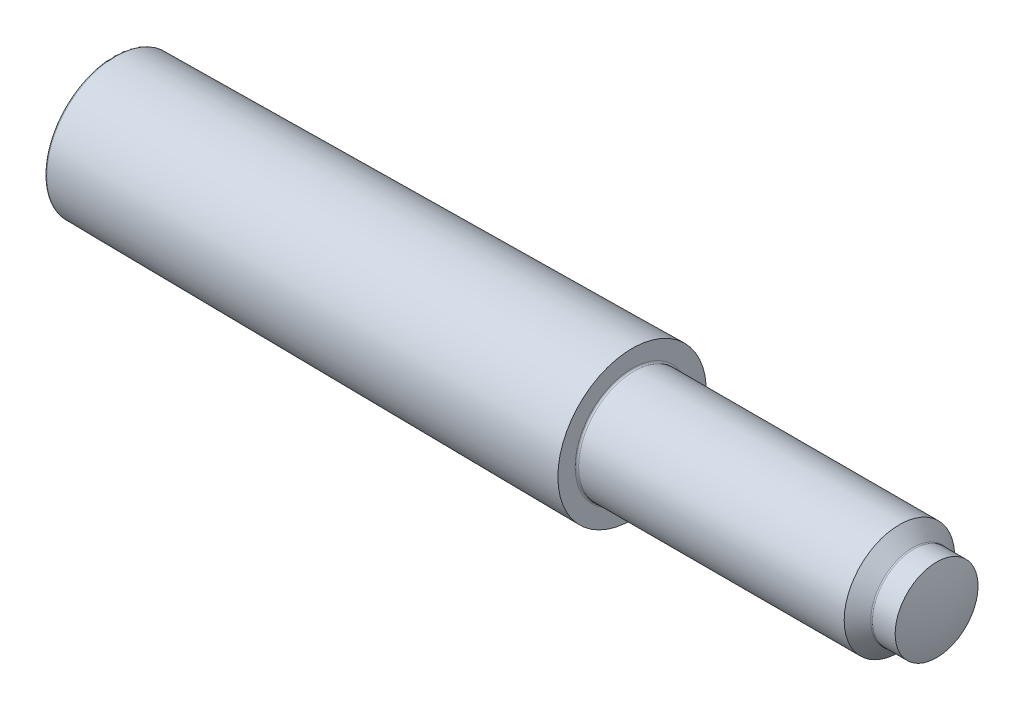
from build123d import *

# Parameters (mm, degrees)
FILLETS_R = 0.25


with BuildPart() as part:
    # BodySke → Body (revolve)
    with BuildSketch(Plane.XY, mode=Mode.PRIVATE) as body_sk:
        with BuildLine():
            Line((0, 0), (0, 10))
            Line((0, 10), (75, 10.749999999))
            Line((75, 10.749999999), (75, 8))
            Line((75, 8), (113.7, 8))
            Line((113.7, 8), (115.7, 6))
            Line((115.7, 6), (119.078784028, 6))
            ThreePointArc((119.078784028, 6), (119.768354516, 3.035153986), (120, 0))
            Line((120, 0), (0, 0))
        make_face()
    revolve(body_sk.sketch.rotate(Axis((-8.740321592, 0, 0), (1, 0, 0)), 90), axis=Axis((-8.740321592, 0, 0), (1, 0, 0)))

    # Fillets
    fillets_edges = [part.edges().sort_by_distance(p)[0] for p in [
        (0, 0, -10),
        (75, 0, -8),
        (115.7, 0, -6),
    ]]
    fillet(fillets_edges, radius=FILLETS_R)


solid = part.part
